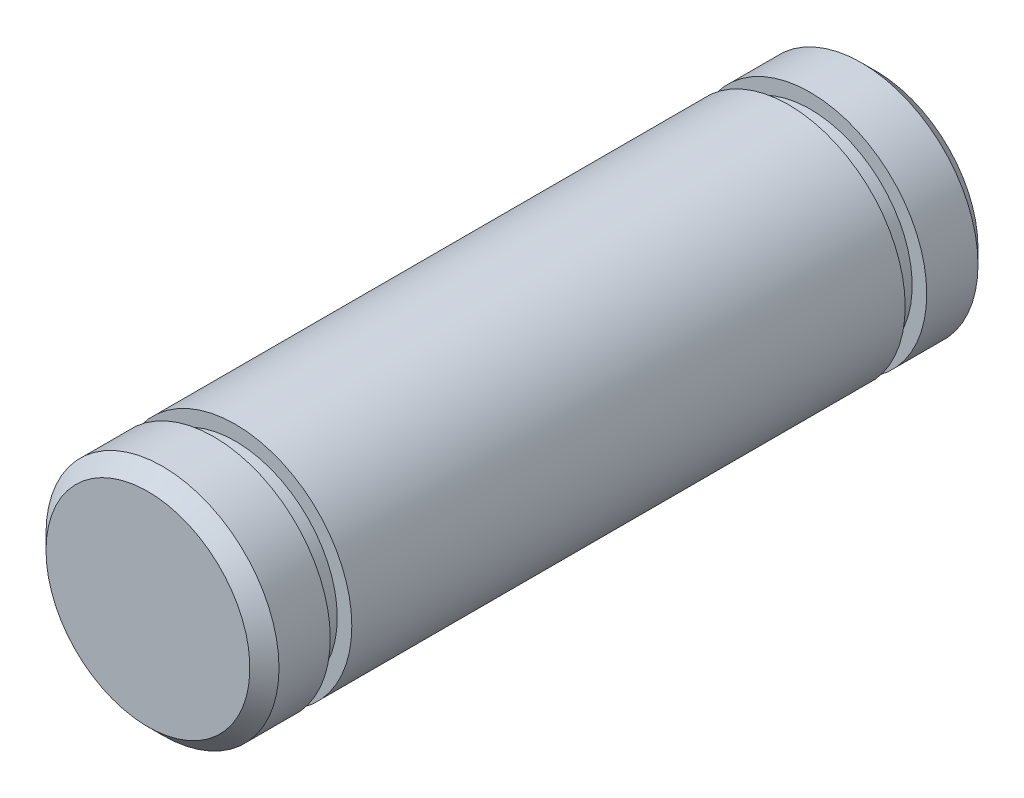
ISO-10303-21;
HEADER;
FILE_DESCRIPTION(('STEP AP214'),'2;1');
FILE_NAME('part.step','',(''),(''),'','','');
FILE_SCHEMA(('AUTOMOTIVE_DESIGN { 1 0 10303 214 1 1 1 1 }'));
ENDSEC;
DATA;
#1=APPLICATION_CONTEXT('core data for automotive mechanical design processes');
#2=APPLICATION_PROTOCOL_DEFINITION('international standard','automotive_design',2000,#1);
#3=PRODUCT_CONTEXT('',#1,'mechanical');
#4=PRODUCT('Part','Part','',(#3));
#5=PRODUCT_RELATED_PRODUCT_CATEGORY('part','',(#4));
#6=PRODUCT_DEFINITION_FORMATION('','',#4);
#7=PRODUCT_DEFINITION_CONTEXT('part definition',#1,'design');
#8=PRODUCT_DEFINITION('design','',#6,#7);
#9=PRODUCT_DEFINITION_SHAPE('','',#8);
#10=(LENGTH_UNIT() NAMED_UNIT(*) SI_UNIT(.MILLI.,.METRE.));
#11=(NAMED_UNIT(*) PLANE_ANGLE_UNIT() SI_UNIT($,.RADIAN.));
#12=(NAMED_UNIT(*) SI_UNIT($,.STERADIAN.) SOLID_ANGLE_UNIT());
#13=UNCERTAINTY_MEASURE_WITH_UNIT(LENGTH_MEASURE(1.E-05),#10,'distance_accuracy_value','');
#14=(GEOMETRIC_REPRESENTATION_CONTEXT(3) GLOBAL_UNCERTAINTY_ASSIGNED_CONTEXT((#13)) GLOBAL_UNIT_ASSIGNED_CONTEXT((#10,
#11,#12)) REPRESENTATION_CONTEXT('',''));
#15=CARTESIAN_POINT('',(0.,0.,0.));
#16=DIRECTION('',(0.,0.,1.));
#17=DIRECTION('',(1.,0.,0.));
#18=AXIS2_PLACEMENT_3D('',#15,#16,#17);
#19=CARTESIAN_POINT('',(0.,0.,12.5));
#20=DIRECTION('',(0.,0.,1.));
#21=DIRECTION('',(1.,0.,0.));
#22=AXIS2_PLACEMENT_3D('',#19,#20,#21);
#23=PLANE('',#22);
#24=CARTESIAN_POINT('',(0.,0.,12.4999999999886));
#25=DIRECTION('',(0.,0.,-1.));
#26=DIRECTION('',(-1.,0.,0.));
#27=AXIS2_PLACEMENT_3D('',#24,#25,#26);
#28=CIRCLE('',#27,3.49999999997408);
#29=CARTESIAN_POINT('',(-3.49999999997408,0.,12.4999999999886));
#30=VERTEX_POINT('',#29);
#31=EDGE_CURVE('E18',#30,#30,#28,.T.);
#32=ORIENTED_EDGE('',*,*,#31,.F.);
#33=EDGE_LOOP('',(#32));
#34=FACE_BOUND('',#33,.T.);
#35=ADVANCED_FACE('F15',(#34),#23,.T.);
#36=CARTESIAN_POINT('',(0.,0.,-12.5));
#37=DIRECTION('',(0.,0.,1.));
#38=DIRECTION('',(1.,0.,0.));
#39=AXIS2_PLACEMENT_3D('',#36,#37,#38);
#40=PLANE('',#39);
#41=CARTESIAN_POINT('',(0.,0.,-12.4999999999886));
#42=DIRECTION('',(0.,0.,1.));
#43=DIRECTION('',(1.,0.,0.));
#44=AXIS2_PLACEMENT_3D('',#41,#42,#43);
#45=CIRCLE('',#44,3.50000000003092);
#46=CARTESIAN_POINT('',(3.50000000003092,0.,-12.4999999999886));
#47=VERTEX_POINT('',#46);
#48=EDGE_CURVE('E50',#47,#47,#45,.T.);
#49=ORIENTED_EDGE('',*,*,#48,.F.);
#50=EDGE_LOOP('',(#49));
#51=FACE_BOUND('',#50,.T.);
#52=ADVANCED_FACE('F62',(#51),#40,.F.);
#53=CARTESIAN_POINT('',(0.,0.,12.0000000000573));
#54=DIRECTION('',(0.,0.,-1.));
#55=DIRECTION('',(-1.,0.,0.));
#56=AXIS2_PLACEMENT_3D('',#53,#54,#55);
#57=CONICAL_SURFACE('',#56,3.99999999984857,0.785398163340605);
#58=ORIENTED_EDGE('',*,*,#31,.T.);
#59=EDGE_LOOP('',(#58));
#60=FACE_BOUND('',#59,.T.);
#61=CARTESIAN_POINT('',(0.,0.,12.));
#62=DIRECTION('',(0.,0.,-1.));
#63=DIRECTION('',(-1.,0.,0.));
#64=AXIS2_PLACEMENT_3D('',#61,#62,#63);
#65=CIRCLE('',#64,4.);
#66=CARTESIAN_POINT('',(-4.,0.,12.));
#67=VERTEX_POINT('',#66);
#68=EDGE_CURVE('E30',#67,#67,#65,.T.);
#69=ORIENTED_EDGE('',*,*,#68,.F.);
#70=EDGE_LOOP('',(#69));
#71=FACE_BOUND('',#70,.T.);
#72=ADVANCED_FACE('F58',(#60,#71),#57,.T.);
#73=CARTESIAN_POINT('',(0.,0.,-12.0000000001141));
#74=DIRECTION('',(0.,0.,1.));
#75=DIRECTION('',(1.,0.,0.));
#76=AXIS2_PLACEMENT_3D('',#73,#74,#75);
#77=CONICAL_SURFACE('',#76,3.99999999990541,0.785398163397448);
#78=ORIENTED_EDGE('',*,*,#48,.T.);
#79=EDGE_LOOP('',(#78));
#80=FACE_BOUND('',#79,.T.);
#81=CARTESIAN_POINT('',(0.,0.,-12.));
#82=DIRECTION('',(0.,0.,-1.));
#83=DIRECTION('',(-1.,0.,0.));
#84=AXIS2_PLACEMENT_3D('',#81,#82,#83);
#85=CIRCLE('',#84,4.);
#86=CARTESIAN_POINT('',(-4.,0.,-12.));
#87=VERTEX_POINT('',#86);
#88=EDGE_CURVE('E49',#87,#87,#85,.F.);
#89=ORIENTED_EDGE('',*,*,#88,.F.);
#90=EDGE_LOOP('',(#89));
#91=FACE_BOUND('',#90,.T.);
#92=ADVANCED_FACE('F106',(#80,#91),#77,.T.);
#93=CARTESIAN_POINT('',(0.,0.,12.5));
#94=DIRECTION('',(0.,0.,-1.));
#95=DIRECTION('',(-1.,0.,0.));
#96=AXIS2_PLACEMENT_3D('',#93,#94,#95);
#97=CYLINDRICAL_SURFACE('',#96,4.);
#98=ORIENTED_EDGE('',*,*,#68,.T.);
#99=EDGE_LOOP('',(#98));
#100=FACE_BOUND('',#99,.T.);
#101=CARTESIAN_POINT('',(0.,0.,10.24));
#102=DIRECTION('',(0.,0.,-1.));
#103=DIRECTION('',(-1.,0.,0.));
#104=AXIS2_PLACEMENT_3D('',#101,#102,#103);
#105=CIRCLE('',#104,4.);
#106=CARTESIAN_POINT('',(-4.,0.,10.24));
#107=VERTEX_POINT('',#106);
#108=EDGE_CURVE('E47',#107,#107,#105,.T.);
#109=ORIENTED_EDGE('',*,*,#108,.F.);
#110=EDGE_LOOP('',(#109));
#111=FACE_BOUND('',#110,.T.);
#112=ADVANCED_FACE('F102',(#100,#111),#97,.T.);
#113=CARTESIAN_POINT('',(0.,0.,12.5));
#114=DIRECTION('',(0.,0.,-1.));
#115=DIRECTION('',(-1.,0.,0.));
#116=AXIS2_PLACEMENT_3D('',#113,#114,#115);
#117=CYLINDRICAL_SURFACE('',#116,4.);
#118=CARTESIAN_POINT('',(0.,0.,-10.24));
#119=DIRECTION('',(0.,0.,-1.));
#120=DIRECTION('',(-1.,0.,0.));
#121=AXIS2_PLACEMENT_3D('',#118,#119,#120);
#122=CIRCLE('',#121,4.);
#123=CARTESIAN_POINT('',(-4.,0.,-10.24));
#124=VERTEX_POINT('',#123);
#125=EDGE_CURVE('E44',#124,#124,#122,.F.);
#126=ORIENTED_EDGE('',*,*,#125,.F.);
#127=EDGE_LOOP('',(#126));
#128=FACE_BOUND('',#127,.T.);
#129=ORIENTED_EDGE('',*,*,#88,.T.);
#130=EDGE_LOOP('',(#129));
#131=FACE_BOUND('',#130,.T.);
#132=ADVANCED_FACE('F98',(#128,#131),#117,.T.);
#133=CARTESIAN_POINT('',(4.,0.,10.24));
#134=DIRECTION('',(0.,0.,-1.));
#135=DIRECTION('',(-1.,0.,0.));
#136=AXIS2_PLACEMENT_3D('',#133,#134,#135);
#137=PLANE('',#136);
#138=ORIENTED_EDGE('',*,*,#108,.T.);
#139=EDGE_LOOP('',(#138));
#140=FACE_BOUND('',#139,.T.);
#141=CARTESIAN_POINT('',(0.,0.,10.24));
#142=DIRECTION('',(0.,0.,1.));
#143=DIRECTION('',(1.,0.,0.));
#144=AXIS2_PLACEMENT_3D('',#141,#142,#143);
#145=CIRCLE('',#144,3.5);
#146=CARTESIAN_POINT('',(3.5,0.,10.24));
#147=VERTEX_POINT('',#146);
#148=EDGE_CURVE('E41',#147,#147,#145,.F.);
#149=ORIENTED_EDGE('',*,*,#148,.F.);
#150=EDGE_LOOP('',(#149));
#151=FACE_BOUND('',#150,.T.);
#152=ADVANCED_FACE('F94',(#140,#151),#137,.T.);
#153=CARTESIAN_POINT('',(4.,0.,-10.24));
#154=DIRECTION('',(0.,0.,1.));
#155=DIRECTION('',(1.,0.,0.));
#156=AXIS2_PLACEMENT_3D('',#153,#154,#155);
#157=PLANE('',#156);
#158=ORIENTED_EDGE('',*,*,#125,.T.);
#159=EDGE_LOOP('',(#158));
#160=FACE_BOUND('',#159,.T.);
#161=CARTESIAN_POINT('',(0.,0.,-10.24));
#162=DIRECTION('',(0.,0.,-1.));
#163=DIRECTION('',(-1.,0.,0.));
#164=AXIS2_PLACEMENT_3D('',#161,#162,#163);
#165=CIRCLE('',#164,3.5);
#166=CARTESIAN_POINT('',(-3.5,0.,-10.24));
#167=VERTEX_POINT('',#166);
#168=EDGE_CURVE('E38',#167,#167,#165,.F.);
#169=ORIENTED_EDGE('',*,*,#168,.F.);
#170=EDGE_LOOP('',(#169));
#171=FACE_BOUND('',#170,.T.);
#172=ADVANCED_FACE('F90',(#160,#171),#157,.T.);
#173=CARTESIAN_POINT('',(0.,0.,12.5));
#174=DIRECTION('',(0.,0.,1.));
#175=DIRECTION('',(1.,0.,0.));
#176=AXIS2_PLACEMENT_3D('',#173,#174,#175);
#177=CYLINDRICAL_SURFACE('',#176,3.5);
#178=ORIENTED_EDGE('',*,*,#148,.T.);
#179=EDGE_LOOP('',(#178));
#180=FACE_BOUND('',#179,.T.);
#181=CARTESIAN_POINT('',(0.,0.,9.5));
#182=DIRECTION('',(0.,0.,1.));
#183=DIRECTION('',(1.,0.,0.));
#184=AXIS2_PLACEMENT_3D('',#181,#182,#183);
#185=CIRCLE('',#184,3.5);
#186=CARTESIAN_POINT('',(3.5,0.,9.5));
#187=VERTEX_POINT('',#186);
#188=EDGE_CURVE('E35',#187,#187,#185,.F.);
#189=ORIENTED_EDGE('',*,*,#188,.F.);
#190=EDGE_LOOP('',(#189));
#191=FACE_BOUND('',#190,.T.);
#192=ADVANCED_FACE('F86',(#180,#191),#177,.T.);
#193=CARTESIAN_POINT('',(0.,0.,-12.5));
#194=DIRECTION('',(0.,0.,-1.));
#195=DIRECTION('',(-1.,0.,0.));
#196=AXIS2_PLACEMENT_3D('',#193,#194,#195);
#197=CYLINDRICAL_SURFACE('',#196,3.5);
#198=CARTESIAN_POINT('',(0.,0.,-9.5));
#199=DIRECTION('',(0.,0.,-1.));
#200=DIRECTION('',(-1.,0.,0.));
#201=AXIS2_PLACEMENT_3D('',#198,#199,#200);
#202=CIRCLE('',#201,3.5);
#203=CARTESIAN_POINT('',(-3.5,0.,-9.5));
#204=VERTEX_POINT('',#203);
#205=EDGE_CURVE('E27',#204,#204,#202,.F.);
#206=ORIENTED_EDGE('',*,*,#205,.F.);
#207=EDGE_LOOP('',(#206));
#208=FACE_BOUND('',#207,.T.);
#209=ORIENTED_EDGE('',*,*,#168,.T.);
#210=EDGE_LOOP('',(#209));
#211=FACE_BOUND('',#210,.T.);
#212=ADVANCED_FACE('F82',(#208,#211),#197,.T.);
#213=CARTESIAN_POINT('',(4.,0.,9.5));
#214=DIRECTION('',(0.,0.,1.));
#215=DIRECTION('',(1.,0.,0.));
#216=AXIS2_PLACEMENT_3D('',#213,#214,#215);
#217=PLANE('',#216);
#218=ORIENTED_EDGE('',*,*,#188,.T.);
#219=EDGE_LOOP('',(#218));
#220=FACE_BOUND('',#219,.T.);
#221=CARTESIAN_POINT('',(0.,0.,9.5));
#222=DIRECTION('',(0.,0.,-1.));
#223=DIRECTION('',(-1.,0.,0.));
#224=AXIS2_PLACEMENT_3D('',#221,#222,#223);
#225=CIRCLE('',#224,4.);
#226=CARTESIAN_POINT('',(-4.,0.,9.5));
#227=VERTEX_POINT('',#226);
#228=EDGE_CURVE('E22',#227,#227,#225,.T.);
#229=ORIENTED_EDGE('',*,*,#228,.F.);
#230=EDGE_LOOP('',(#229));
#231=FACE_BOUND('',#230,.T.);
#232=ADVANCED_FACE('F75',(#220,#231),#217,.T.);
#233=CARTESIAN_POINT('',(4.,0.,-9.5));
#234=DIRECTION('',(0.,0.,-1.));
#235=DIRECTION('',(-1.,0.,0.));
#236=AXIS2_PLACEMENT_3D('',#233,#234,#235);
#237=PLANE('',#236);
#238=ORIENTED_EDGE('',*,*,#205,.T.);
#239=EDGE_LOOP('',(#238));
#240=FACE_BOUND('',#239,.T.);
#241=CARTESIAN_POINT('',(0.,0.,-9.5));
#242=DIRECTION('',(0.,0.,-1.));
#243=DIRECTION('',(-1.,0.,0.));
#244=AXIS2_PLACEMENT_3D('',#241,#242,#243);
#245=CIRCLE('',#244,4.);
#246=CARTESIAN_POINT('',(-4.,0.,-9.5));
#247=VERTEX_POINT('',#246);
#248=EDGE_CURVE('E10',#247,#247,#245,.F.);
#249=ORIENTED_EDGE('',*,*,#248,.F.);
#250=EDGE_LOOP('',(#249));
#251=FACE_BOUND('',#250,.T.);
#252=ADVANCED_FACE('F70',(#240,#251),#237,.T.);
#253=CARTESIAN_POINT('',(0.,0.,12.5));
#254=DIRECTION('',(0.,0.,-1.));
#255=DIRECTION('',(-1.,0.,0.));
#256=AXIS2_PLACEMENT_3D('',#253,#254,#255);
#257=CYLINDRICAL_SURFACE('',#256,4.);
#258=ORIENTED_EDGE('',*,*,#248,.T.);
#259=EDGE_LOOP('',(#258));
#260=FACE_BOUND('',#259,.T.);
#261=ORIENTED_EDGE('',*,*,#228,.T.);
#262=EDGE_LOOP('',(#261));
#263=FACE_BOUND('',#262,.T.);
#264=ADVANCED_FACE('F68',(#260,#263),#257,.T.);
#265=CLOSED_SHELL('',(#35,#52,#72,#92,#112,#132,#152,#172,#192,#212,#232,#252,#264));
#266=MANIFOLD_SOLID_BREP('B1',#265);
#267=ADVANCED_BREP_SHAPE_REPRESENTATION('',(#18,#266),#14);
#268=SHAPE_DEFINITION_REPRESENTATION(#9,#267);
ENDSEC;
END-ISO-10303-21;
